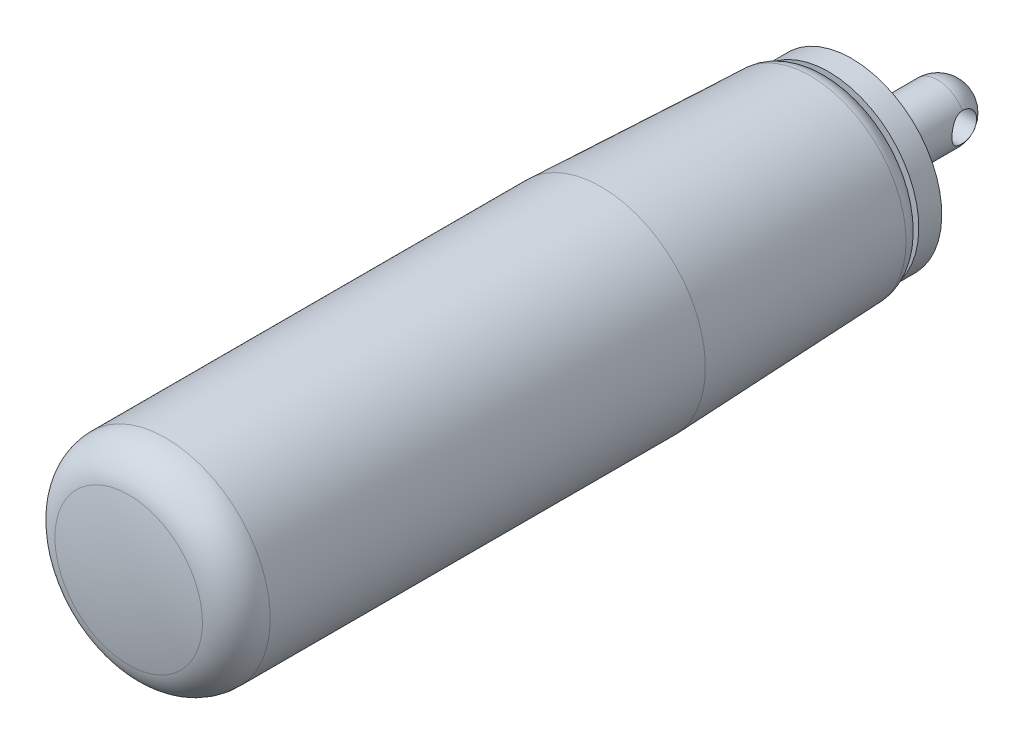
ISO-10303-21;
HEADER;
FILE_DESCRIPTION(('STEP AP214'),'2;1');
FILE_NAME('part.step','',(''),(''),'','','');
FILE_SCHEMA(('AUTOMOTIVE_DESIGN { 1 0 10303 214 1 1 1 1 }'));
ENDSEC;
DATA;
#1=APPLICATION_CONTEXT('core data for automotive mechanical design processes');
#2=APPLICATION_PROTOCOL_DEFINITION('international standard','automotive_design',2000,#1);
#3=PRODUCT_CONTEXT('',#1,'mechanical');
#4=PRODUCT('Part','Part','',(#3));
#5=PRODUCT_RELATED_PRODUCT_CATEGORY('part','',(#4));
#6=PRODUCT_DEFINITION_FORMATION('','',#4);
#7=PRODUCT_DEFINITION_CONTEXT('part definition',#1,'design');
#8=PRODUCT_DEFINITION('design','',#6,#7);
#9=PRODUCT_DEFINITION_SHAPE('','',#8);
#10=(LENGTH_UNIT() NAMED_UNIT(*) SI_UNIT(.MILLI.,.METRE.));
#11=(NAMED_UNIT(*) PLANE_ANGLE_UNIT() SI_UNIT($,.RADIAN.));
#12=(NAMED_UNIT(*) SI_UNIT($,.STERADIAN.) SOLID_ANGLE_UNIT());
#13=UNCERTAINTY_MEASURE_WITH_UNIT(LENGTH_MEASURE(1.E-05),#10,'distance_accuracy_value','');
#14=(GEOMETRIC_REPRESENTATION_CONTEXT(3) GLOBAL_UNCERTAINTY_ASSIGNED_CONTEXT((#13)) GLOBAL_UNIT_ASSIGNED_CONTEXT((#10,
#11,#12)) REPRESENTATION_CONTEXT('',''));
#15=CARTESIAN_POINT('',(0.,0.,0.));
#16=DIRECTION('',(0.,0.,1.));
#17=DIRECTION('',(1.,0.,0.));
#18=AXIS2_PLACEMENT_3D('',#15,#16,#17);
#19=CARTESIAN_POINT('',(0.,0.,46.0750337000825));
#20=DIRECTION('',(0.,1.,0.));
#21=DIRECTION('',(1.,0.,0.));
#22=AXIS2_PLACEMENT_3D('',#19,#20,#21);
#23=SPHERICAL_SURFACE('',#22,40.);
#24=CARTESIAN_POINT('',(0.,0.,46.0750337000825));
#25=DIRECTION('',(0.,0.,-1.));
#26=DIRECTION('',(0.,1.,0.));
#27=AXIS2_PLACEMENT_3D('',#24,#25,#26);
#28=SPHERICAL_SURFACE('',#27,40.);
#29=CARTESIAN_POINT('',(0.,0.,85.3115749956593));
#30=DIRECTION('',(0.,0.,-1.));
#31=DIRECTION('',(0.,1.,0.));
#32=AXIS2_PLACEMENT_3D('',#29,#30,#31);
#33=CIRCLE('',#32,7.77777777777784);
#34=CARTESIAN_POINT('',(0.,7.77777777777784,85.3115749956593));
#35=VERTEX_POINT('',#34);
#36=EDGE_CURVE('E110',#35,#35,#33,.T.);
#37=ORIENTED_EDGE('',*,*,#36,.F.);
#38=EDGE_LOOP('',(#37));
#39=FACE_BOUND('',#38,.T.);
#40=ADVANCED_FACE('F14',(#39),#28,.T.);
#41=CARTESIAN_POINT('',(0.,0.,0.));
#42=DIRECTION('',(0.,1.,0.));
#43=DIRECTION('',(1.,0.,0.));
#44=AXIS2_PLACEMENT_3D('',#41,#42,#43);
#45=SPHERICAL_SURFACE('',#44,3.);
#46=CARTESIAN_POINT('',(2.59807621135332,0.,0.));
#47=DIRECTION('',(-1.,0.,0.));
#48=DIRECTION('',(0.,1.,0.));
#49=AXIS2_PLACEMENT_3D('',#46,#47,#48);
#50=CIRCLE('',#49,1.5);
#51=CARTESIAN_POINT('',(2.59807621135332,-1.5,0.));
#52=VERTEX_POINT('',#51);
#53=CARTESIAN_POINT('',(2.59807621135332,1.5,0.));
#54=VERTEX_POINT('',#53);
#55=EDGE_CURVE('E38',#52,#54,#50,.F.);
#56=ORIENTED_EDGE('',*,*,#55,.F.);
#57=CARTESIAN_POINT('',(0.,0.,0.));
#58=DIRECTION('',(0.,0.,-1.));
#59=DIRECTION('',(0.,1.,0.));
#60=AXIS2_PLACEMENT_3D('',#57,#58,#59);
#61=CIRCLE('',#60,3.);
#62=CARTESIAN_POINT('',(-2.59807621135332,-1.5,0.));
#63=VERTEX_POINT('',#62);
#64=EDGE_CURVE('E48',#52,#63,#61,.T.);
#65=ORIENTED_EDGE('',*,*,#64,.T.);
#66=CARTESIAN_POINT('',(-2.59807621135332,0.,0.));
#67=DIRECTION('',(1.,0.,0.));
#68=DIRECTION('',(0.,-1.,0.));
#69=AXIS2_PLACEMENT_3D('',#66,#67,#68);
#70=CIRCLE('',#69,1.5);
#71=CARTESIAN_POINT('',(-2.59807621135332,1.5,0.));
#72=VERTEX_POINT('',#71);
#73=EDGE_CURVE('E31',#72,#63,#70,.F.);
#74=ORIENTED_EDGE('',*,*,#73,.F.);
#75=EDGE_CURVE('E52',#72,#54,#61,.T.);
#76=ORIENTED_EDGE('',*,*,#75,.T.);
#77=EDGE_LOOP('',(#56,#65,#74,#76));
#78=FACE_BOUND('',#77,.T.);
#79=ADVANCED_FACE('F51',(#78),#45,.T.);
#80=CARTESIAN_POINT('',(0.,0.,-20.));
#81=DIRECTION('',(0.,0.,-1.));
#82=DIRECTION('',(0.,1.,0.));
#83=AXIS2_PLACEMENT_3D('',#80,#81,#82);
#84=CYLINDRICAL_SURFACE('',#83,3.);
#85=CARTESIAN_POINT('',(-2.59807621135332,-1.5,0.));
#86=CARTESIAN_POINT('',(-2.59808302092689,-1.4999945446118,0.0781617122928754));
#87=CARTESIAN_POINT('',(-2.60165701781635,-1.49384995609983,0.156422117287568));
#88=CARTESIAN_POINT('',(-2.61543549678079,-1.46958481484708,0.31054089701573));
#89=CARTESIAN_POINT('',(-2.62565391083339,-1.45143909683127,0.386393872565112));
#90=CARTESIAN_POINT('',(-2.65124019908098,-1.40414992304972,0.533177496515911));
#91=CARTESIAN_POINT('',(-2.66658065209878,-1.3750649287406,0.604131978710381));
#92=CARTESIAN_POINT('',(-2.70063997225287,-1.30690128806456,0.74013630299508));
#93=CARTESIAN_POINT('',(-2.71935902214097,-1.26782210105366,0.805185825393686));
#94=CARTESIAN_POINT('',(-2.75995303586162,-1.17699981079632,0.933458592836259));
#95=CARTESIAN_POINT('',(-2.7819609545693,-1.12447805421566,0.996088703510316));
#96=CARTESIAN_POINT('',(-2.82557974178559,-1.0098807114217,1.11211258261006));
#97=CARTESIAN_POINT('',(-2.84719040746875,-0.94780038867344,1.16550174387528));
#98=CARTESIAN_POINT('',(-2.88932215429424,-0.81073434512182,1.26505072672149));
#99=CARTESIAN_POINT('',(-2.90967159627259,-0.735160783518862,1.3104806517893));
#100=CARTESIAN_POINT('',(-2.94526134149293,-0.576235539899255,1.38771127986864));
#101=CARTESIAN_POINT('',(-2.96050486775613,-0.492888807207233,1.41952058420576));
#102=CARTESIAN_POINT('',(-2.98320691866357,-0.327067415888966,1.46625699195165));
#103=CARTESIAN_POINT('',(-2.99114220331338,-0.244952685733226,1.4822242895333));
#104=CARTESIAN_POINT('',(-3.000113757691,-0.0788559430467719,1.50024917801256));
#105=CARTESIAN_POINT('',(-3.00115420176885,0.0051249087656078,1.50231518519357));
#106=CARTESIAN_POINT('',(-2.99644472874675,0.164748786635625,1.49287998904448));
#107=CARTESIAN_POINT('',(-2.99127743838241,0.240481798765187,1.48254297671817));
#108=CARTESIAN_POINT('',(-2.97561367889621,0.388970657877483,1.45067873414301));
#109=CARTESIAN_POINT('',(-2.96511681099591,0.461726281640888,1.42915066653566));
#110=CARTESIAN_POINT('',(-2.93957374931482,0.60346408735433,1.37537615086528));
#111=CARTESIAN_POINT('',(-2.92446662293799,0.672380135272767,1.3429855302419));
#112=CARTESIAN_POINT('',(-2.89106468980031,0.803965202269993,1.26860487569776));
#113=CARTESIAN_POINT('',(-2.87276874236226,0.866631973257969,1.22661140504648));
#114=CARTESIAN_POINT('',(-2.83266591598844,0.990260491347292,1.12965697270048));
#115=CARTESIAN_POINT('',(-2.81069063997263,1.05050111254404,1.07384545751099));
#116=CARTESIAN_POINT('',(-2.76681510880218,1.16115655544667,0.953115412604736));
#117=CARTESIAN_POINT('',(-2.74491492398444,1.21156381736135,0.888189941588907));
#118=CARTESIAN_POINT('',(-2.70216234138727,1.30425800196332,0.746027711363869));
#119=CARTESIAN_POINT('',(-2.68146479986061,1.34582597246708,0.668270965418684));
#120=CARTESIAN_POINT('',(-2.64563175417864,1.41497866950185,0.505593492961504));
#121=CARTESIAN_POINT('',(-2.63049045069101,1.44257798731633,0.420680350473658));
#122=CARTESIAN_POINT('',(-2.60916953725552,1.48077031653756,0.253178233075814));
#123=CARTESIAN_POINT('',(-2.60237483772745,1.49253768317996,0.170938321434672));
#124=CARTESIAN_POINT('',(-2.59676879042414,1.50227541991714,0.00539798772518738));
#125=CARTESIAN_POINT('',(-2.59795180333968,1.50025553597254,-0.0779016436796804));
#126=CARTESIAN_POINT('',(-2.60751504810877,1.48355406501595,-0.233480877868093));
#127=CARTESIAN_POINT('',(-2.61509381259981,1.4702817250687,-0.305969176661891));
#128=CARTESIAN_POINT('',(-2.63541032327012,1.43354442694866,-0.447551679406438));
#129=CARTESIAN_POINT('',(-2.64814974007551,1.41007616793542,-0.516644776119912));
#130=CARTESIAN_POINT('',(-2.67804333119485,1.35247138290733,-0.653116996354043));
#131=CARTESIAN_POINT('',(-2.69537464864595,1.31789109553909,-0.720268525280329));
#132=CARTESIAN_POINT('',(-2.73234179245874,1.23943059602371,-0.848203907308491));
#133=CARTESIAN_POINT('',(-2.75197880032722,1.19554560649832,-0.908984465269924));
#134=CARTESIAN_POINT('',(-2.79431997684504,1.09325575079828,-1.03046815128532));
#135=CARTESIAN_POINT('',(-2.81709874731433,1.03371790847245,-1.09019572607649));
#136=CARTESIAN_POINT('',(-2.86101352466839,0.905106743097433,-1.19911835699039));
#137=CARTESIAN_POINT('',(-2.88214897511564,0.836030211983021,-1.24830985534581));
#138=CARTESIAN_POINT('',(-2.92112042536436,0.687803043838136,-1.33586058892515));
#139=CARTESIAN_POINT('',(-2.93885462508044,0.608434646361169,-1.37389967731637));
#140=CARTESIAN_POINT('',(-2.96825032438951,0.443283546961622,-1.43570685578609));
#141=CARTESIAN_POINT('',(-2.9799171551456,0.357506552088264,-1.45948747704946));
#142=CARTESIAN_POINT('',(-2.99501262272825,0.190469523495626,-1.49005284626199));
#143=CARTESIAN_POINT('',(-2.99909891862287,0.109517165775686,-1.49819681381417));
#144=CARTESIAN_POINT('',(-3.00063195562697,-0.0526889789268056,-1.5012648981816));
#145=CARTESIAN_POINT('',(-2.99808102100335,-0.13394265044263,-1.49619364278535));
#146=CARTESIAN_POINT('',(-2.98700953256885,-0.288806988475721,-1.47387538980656));
#147=CARTESIAN_POINT('',(-2.97889342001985,-0.362568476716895,-1.45745272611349));
#148=CARTESIAN_POINT('',(-2.95788140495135,-0.506168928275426,-1.41400950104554));
#149=CARTESIAN_POINT('',(-2.94498481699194,-0.576007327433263,-1.38698741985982));
#150=CARTESIAN_POINT('',(-2.91488896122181,-0.713135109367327,-1.32190942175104));
#151=CARTESIAN_POINT('',(-2.89752925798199,-0.780187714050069,-1.28343101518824));
#152=CARTESIAN_POINT('',(-2.86032199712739,-0.907161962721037,-1.19706310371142));
#153=CARTESIAN_POINT('',(-2.84047329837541,-0.967080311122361,-1.14916927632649));
#154=CARTESIAN_POINT('',(-2.79792915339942,-1.08437100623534,-1.03980429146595));
#155=CARTESIAN_POINT('',(-2.77514698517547,-1.14089652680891,-0.977456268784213));
#156=CARTESIAN_POINT('',(-2.73094614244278,-1.24299493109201,-0.843823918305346));
#157=CARTESIAN_POINT('',(-2.70952868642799,-1.28855812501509,-0.772531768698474));
#158=CARTESIAN_POINT('',(-2.66999407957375,-1.36864661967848,-0.620045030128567));
#159=CARTESIAN_POINT('',(-2.65200261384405,-1.40277759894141,-0.538608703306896));
#160=CARTESIAN_POINT('',(-2.62299234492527,-1.45631806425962,-0.370001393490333));
#161=CARTESIAN_POINT('',(-2.61195024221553,-1.47577678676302,-0.28285066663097));
#162=CARTESIAN_POINT('',(-2.60293908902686,-1.49155051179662,-0.162291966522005));
#163=CARTESIAN_POINT('',(-2.60112193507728,-1.49471415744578,-0.129948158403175));
#164=CARTESIAN_POINT('',(-2.59868903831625,-1.49894010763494,-0.0650752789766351));
#165=CARTESIAN_POINT('',(-2.59807337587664,-1.50000227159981,-0.0325461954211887));
#166=CARTESIAN_POINT('',(-2.59807621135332,-1.5,0.));
#167=B_SPLINE_CURVE_WITH_KNOTS('',3,(#85,#86,#87,#88,#89,#90,#91,#92,#93,#94,#95,#96,#97,#98,
#99,#100,#101,#102,#103,#104,#105,#106,#107,#108,#109,#110,#111,#112,#113,#114,#115,#116,#117,
#118,#119,#120,#121,#122,#123,#124,#125,#126,#127,#128,#129,#130,#131,#132,#133,#134,#135,#136,
#137,#138,#139,#140,#141,#142,#143,#144,#145,#146,#147,#148,#149,#150,#151,#152,#153,#154,#155,
#156,#157,#158,#159,#160,#161,#162,#163,#164,#165,#166),.UNSPECIFIED.,.T.,.F.,(4,2,2,2,2,2,2,2,
2,2,2,2,2,2,2,2,2,2,2,2,2,2,2,2,2,2,2,2,2,2,2,2,2,2,2,2,2,2,2,2,4),(0.,0.234348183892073,
0.469189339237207,0.702792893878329,0.936409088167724,1.18929346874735,1.44230356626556,
1.71236838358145,1.98226240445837,2.23295227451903,2.4834903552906,2.71224146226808,
2.94100968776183,3.1729430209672,3.40495949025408,3.65890787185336,3.91305072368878,
4.18333262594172,4.45333161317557,4.70193436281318,4.95036139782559,5.17161275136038,
5.39293578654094,5.62450944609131,5.85620229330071,6.1171011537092,6.37808797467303,
6.64596272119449,6.91360169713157,7.1566840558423,7.39968130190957,7.62666637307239,
7.85368400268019,8.09041126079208,8.32724745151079,8.58765362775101,8.84828914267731,
9.11716123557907,9.3851269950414,9.48270202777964,9.58028358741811),.UNSPECIFIED.);
#168=EDGE_CURVE('E9',#63,#72,#167,.T.);
#169=ORIENTED_EDGE('',*,*,#168,.F.);
#170=ORIENTED_EDGE('',*,*,#64,.F.);
#171=CARTESIAN_POINT('',(2.59807621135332,-1.5,0.));
#172=CARTESIAN_POINT('',(2.59808302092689,-1.4999945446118,-0.0781617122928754));
#173=CARTESIAN_POINT('',(2.60165701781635,-1.49384995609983,-0.156422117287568));
#174=CARTESIAN_POINT('',(2.61543549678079,-1.46958481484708,-0.31054089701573));
#175=CARTESIAN_POINT('',(2.62565391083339,-1.45143909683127,-0.386393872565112));
#176=CARTESIAN_POINT('',(2.65124019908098,-1.40414992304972,-0.533177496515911));
#177=CARTESIAN_POINT('',(2.66658065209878,-1.3750649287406,-0.604131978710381));
#178=CARTESIAN_POINT('',(2.70063997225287,-1.30690128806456,-0.74013630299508));
#179=CARTESIAN_POINT('',(2.71935902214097,-1.26782210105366,-0.805185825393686));
#180=CARTESIAN_POINT('',(2.75995303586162,-1.17699981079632,-0.933458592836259));
#181=CARTESIAN_POINT('',(2.7819609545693,-1.12447805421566,-0.996088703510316));
#182=CARTESIAN_POINT('',(2.82557974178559,-1.0098807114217,-1.11211258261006));
#183=CARTESIAN_POINT('',(2.84719040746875,-0.94780038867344,-1.16550174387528));
#184=CARTESIAN_POINT('',(2.88932215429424,-0.81073434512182,-1.26505072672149));
#185=CARTESIAN_POINT('',(2.90967159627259,-0.735160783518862,-1.3104806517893));
#186=CARTESIAN_POINT('',(2.94526134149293,-0.576235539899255,-1.38771127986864));
#187=CARTESIAN_POINT('',(2.96050486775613,-0.492888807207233,-1.41952058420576));
#188=CARTESIAN_POINT('',(2.98320691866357,-0.327067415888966,-1.46625699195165));
#189=CARTESIAN_POINT('',(2.99114220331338,-0.244952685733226,-1.4822242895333));
#190=CARTESIAN_POINT('',(3.000113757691,-0.0788559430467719,-1.50024917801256));
#191=CARTESIAN_POINT('',(3.00115420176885,0.0051249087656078,-1.50231518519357));
#192=CARTESIAN_POINT('',(2.99644472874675,0.164748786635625,-1.49287998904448));
#193=CARTESIAN_POINT('',(2.99127743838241,0.240481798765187,-1.48254297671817));
#194=CARTESIAN_POINT('',(2.97561367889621,0.388970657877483,-1.45067873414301));
#195=CARTESIAN_POINT('',(2.96511681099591,0.461726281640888,-1.42915066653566));
#196=CARTESIAN_POINT('',(2.93957374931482,0.60346408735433,-1.37537615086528));
#197=CARTESIAN_POINT('',(2.92446662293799,0.672380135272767,-1.3429855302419));
#198=CARTESIAN_POINT('',(2.89106468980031,0.803965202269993,-1.26860487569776));
#199=CARTESIAN_POINT('',(2.87276874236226,0.866631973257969,-1.22661140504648));
#200=CARTESIAN_POINT('',(2.83266591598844,0.990260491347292,-1.12965697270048));
#201=CARTESIAN_POINT('',(2.81069063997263,1.05050111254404,-1.07384545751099));
#202=CARTESIAN_POINT('',(2.76681510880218,1.16115655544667,-0.953115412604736));
#203=CARTESIAN_POINT('',(2.74491492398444,1.21156381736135,-0.888189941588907));
#204=CARTESIAN_POINT('',(2.70216234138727,1.30425800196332,-0.746027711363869));
#205=CARTESIAN_POINT('',(2.68146479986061,1.34582597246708,-0.668270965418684));
#206=CARTESIAN_POINT('',(2.64563175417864,1.41497866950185,-0.505593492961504));
#207=CARTESIAN_POINT('',(2.63049045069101,1.44257798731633,-0.420680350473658));
#208=CARTESIAN_POINT('',(2.60916953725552,1.48077031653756,-0.253178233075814));
#209=CARTESIAN_POINT('',(2.60237483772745,1.49253768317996,-0.170938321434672));
#210=CARTESIAN_POINT('',(2.59676879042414,1.50227541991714,-0.00539798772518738));
#211=CARTESIAN_POINT('',(2.59795180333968,1.50025553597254,0.0779016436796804));
#212=CARTESIAN_POINT('',(2.60751504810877,1.48355406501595,0.233480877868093));
#213=CARTESIAN_POINT('',(2.61509381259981,1.4702817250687,0.305969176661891));
#214=CARTESIAN_POINT('',(2.63541032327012,1.43354442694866,0.447551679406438));
#215=CARTESIAN_POINT('',(2.64814974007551,1.41007616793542,0.516644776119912));
#216=CARTESIAN_POINT('',(2.67804333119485,1.35247138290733,0.653116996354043));
#217=CARTESIAN_POINT('',(2.69537464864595,1.31789109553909,0.720268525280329));
#218=CARTESIAN_POINT('',(2.73234179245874,1.23943059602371,0.848203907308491));
#219=CARTESIAN_POINT('',(2.75197880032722,1.19554560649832,0.908984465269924));
#220=CARTESIAN_POINT('',(2.79431997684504,1.09325575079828,1.03046815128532));
#221=CARTESIAN_POINT('',(2.81709874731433,1.03371790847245,1.09019572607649));
#222=CARTESIAN_POINT('',(2.86101352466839,0.905106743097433,1.19911835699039));
#223=CARTESIAN_POINT('',(2.88214897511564,0.836030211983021,1.24830985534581));
#224=CARTESIAN_POINT('',(2.92112042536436,0.687803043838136,1.33586058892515));
#225=CARTESIAN_POINT('',(2.93885462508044,0.608434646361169,1.37389967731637));
#226=CARTESIAN_POINT('',(2.96825032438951,0.443283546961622,1.43570685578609));
#227=CARTESIAN_POINT('',(2.9799171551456,0.357506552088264,1.45948747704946));
#228=CARTESIAN_POINT('',(2.99501262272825,0.190469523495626,1.49005284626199));
#229=CARTESIAN_POINT('',(2.99909891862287,0.109517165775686,1.49819681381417));
#230=CARTESIAN_POINT('',(3.00063195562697,-0.0526889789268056,1.5012648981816));
#231=CARTESIAN_POINT('',(2.99808102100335,-0.13394265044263,1.49619364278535));
#232=CARTESIAN_POINT('',(2.98700953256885,-0.288806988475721,1.47387538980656));
#233=CARTESIAN_POINT('',(2.97889342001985,-0.362568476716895,1.45745272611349));
#234=CARTESIAN_POINT('',(2.95788140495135,-0.506168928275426,1.41400950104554));
#235=CARTESIAN_POINT('',(2.94498481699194,-0.576007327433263,1.38698741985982));
#236=CARTESIAN_POINT('',(2.91488896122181,-0.713135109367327,1.32190942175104));
#237=CARTESIAN_POINT('',(2.89752925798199,-0.780187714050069,1.28343101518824));
#238=CARTESIAN_POINT('',(2.86032199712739,-0.907161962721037,1.19706310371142));
#239=CARTESIAN_POINT('',(2.84047329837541,-0.967080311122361,1.14916927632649));
#240=CARTESIAN_POINT('',(2.79792915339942,-1.08437100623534,1.03980429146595));
#241=CARTESIAN_POINT('',(2.77514698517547,-1.14089652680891,0.977456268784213));
#242=CARTESIAN_POINT('',(2.73094614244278,-1.24299493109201,0.843823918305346));
#243=CARTESIAN_POINT('',(2.70952868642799,-1.28855812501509,0.772531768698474));
#244=CARTESIAN_POINT('',(2.66999407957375,-1.36864661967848,0.620045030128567));
#245=CARTESIAN_POINT('',(2.65200261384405,-1.40277759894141,0.538608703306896));
#246=CARTESIAN_POINT('',(2.62299234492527,-1.45631806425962,0.370001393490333));
#247=CARTESIAN_POINT('',(2.61195024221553,-1.47577678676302,0.28285066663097));
#248=CARTESIAN_POINT('',(2.60293908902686,-1.49155051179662,0.162291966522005));
#249=CARTESIAN_POINT('',(2.60112193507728,-1.49471415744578,0.129948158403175));
#250=CARTESIAN_POINT('',(2.59868903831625,-1.49894010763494,0.0650752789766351));
#251=CARTESIAN_POINT('',(2.59807337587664,-1.50000227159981,0.0325461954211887));
#252=CARTESIAN_POINT('',(2.59807621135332,-1.5,0.));
#253=B_SPLINE_CURVE_WITH_KNOTS('',3,(#171,#172,#173,#174,#175,#176,#177,#178,#179,#180,#181,
#182,#183,#184,#185,#186,#187,#188,#189,#190,#191,#192,#193,#194,#195,#196,#197,#198,#199,#200,
#201,#202,#203,#204,#205,#206,#207,#208,#209,#210,#211,#212,#213,#214,#215,#216,#217,#218,#219,
#220,#221,#222,#223,#224,#225,#226,#227,#228,#229,#230,#231,#232,#233,#234,#235,#236,#237,#238,
#239,#240,#241,#242,#243,#244,#245,#246,#247,#248,#249,#250,#251,#252),.UNSPECIFIED.,.T.,.F.,(4,
2,2,2,2,2,2,2,2,2,2,2,2,2,2,2,2,2,2,2,2,2,2,2,2,2,2,2,2,2,2,2,2,2,2,2,2,2,2,2,4),(0.,
0.234348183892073,0.469189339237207,0.702792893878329,0.936409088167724,1.18929346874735,
1.44230356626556,1.71236838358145,1.98226240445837,2.23295227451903,2.4834903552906,
2.71224146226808,2.94100968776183,3.1729430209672,3.40495949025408,3.65890787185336,
3.91305072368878,4.18333262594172,4.45333161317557,4.70193436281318,4.95036139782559,
5.17161275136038,5.39293578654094,5.62450944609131,5.85620229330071,6.1171011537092,
6.37808797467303,6.64596272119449,6.91360169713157,7.1566840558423,7.39968130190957,
7.62666637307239,7.85368400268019,8.09041126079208,8.32724745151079,8.58765362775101,
8.84828914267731,9.11716123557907,9.3851269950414,9.48270202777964,9.58028358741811),.UNSPECIFIED.);
#254=EDGE_CURVE('E26',#54,#52,#253,.T.);
#255=ORIENTED_EDGE('',*,*,#254,.F.);
#256=ORIENTED_EDGE('',*,*,#75,.F.);
#257=EDGE_LOOP('',(#169,#170,#255,#256));
#258=FACE_BOUND('',#257,.T.);
#259=CARTESIAN_POINT('',(0.,0.,9.07503370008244));
#260=DIRECTION('',(0.,0.,-1.));
#261=DIRECTION('',(0.,1.,0.));
#262=AXIS2_PLACEMENT_3D('',#259,#260,#261);
#263=CIRCLE('',#262,3.);
#264=CARTESIAN_POINT('',(0.,3.,9.07503370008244));
#265=VERTEX_POINT('',#264);
#266=EDGE_CURVE('E57',#265,#265,#263,.T.);
#267=ORIENTED_EDGE('',*,*,#266,.T.);
#268=EDGE_LOOP('',(#267));
#269=FACE_BOUND('',#268,.T.);
#270=ADVANCED_FACE('F54',(#258,#269),#84,.T.);
#271=CARTESIAN_POINT('',(-9.49999999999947,0.,9.07503370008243));
#272=DIRECTION('',(0.,0.,1.));
#273=DIRECTION('',(0.,-1.,0.));
#274=AXIS2_PLACEMENT_3D('',#271,#272,#273);
#275=PLANE('',#274);
#276=ORIENTED_EDGE('',*,*,#266,.F.);
#277=EDGE_LOOP('',(#276));
#278=FACE_BOUND('',#277,.T.);
#279=CARTESIAN_POINT('',(0.,0.,9.07503370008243));
#280=DIRECTION('',(0.,0.,-1.));
#281=DIRECTION('',(0.,1.,0.));
#282=AXIS2_PLACEMENT_3D('',#279,#280,#281);
#283=CIRCLE('',#282,9.49999999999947);
#284=CARTESIAN_POINT('',(0.,9.49999999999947,9.07503370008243));
#285=VERTEX_POINT('',#284);
#286=EDGE_CURVE('E128',#285,#285,#283,.T.);
#287=ORIENTED_EDGE('',*,*,#286,.T.);
#288=EDGE_LOOP('',(#287));
#289=FACE_BOUND('',#288,.T.);
#290=ADVANCED_FACE('F91',(#278,#289),#275,.F.);
#291=CARTESIAN_POINT('',(0.,0.,-20.));
#292=DIRECTION('',(0.,0.,-1.));
#293=DIRECTION('',(0.,1.,0.));
#294=AXIS2_PLACEMENT_3D('',#291,#292,#293);
#295=CYLINDRICAL_SURFACE('',#294,9.49999999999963);
#296=ORIENTED_EDGE('',*,*,#286,.F.);
#297=EDGE_LOOP('',(#296));
#298=FACE_BOUND('',#297,.T.);
#299=CARTESIAN_POINT('',(0.,0.,11.5));
#300=DIRECTION('',(0.,0.,-1.));
#301=DIRECTION('',(0.,1.,0.));
#302=AXIS2_PLACEMENT_3D('',#299,#300,#301);
#303=CIRCLE('',#302,9.49999999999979);
#304=CARTESIAN_POINT('',(0.,9.49999999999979,11.5));
#305=VERTEX_POINT('',#304);
#306=EDGE_CURVE('E126',#305,#305,#303,.T.);
#307=ORIENTED_EDGE('',*,*,#306,.T.);
#308=EDGE_LOOP('',(#307));
#309=FACE_BOUND('',#308,.T.);
#310=ADVANCED_FACE('F88',(#298,#309),#295,.T.);
#311=CARTESIAN_POINT('',(-8.08159797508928,0.,11.5));
#312=DIRECTION('',(0.,0.,-1.));
#313=DIRECTION('',(0.,1.,0.));
#314=AXIS2_PLACEMENT_3D('',#311,#312,#313);
#315=PLANE('',#314);
#316=ORIENTED_EDGE('',*,*,#306,.F.);
#317=EDGE_LOOP('',(#316));
#318=FACE_BOUND('',#317,.T.);
#319=CARTESIAN_POINT('',(0.,0.,11.5));
#320=DIRECTION('',(0.,0.,-1.));
#321=DIRECTION('',(0.,1.,0.));
#322=AXIS2_PLACEMENT_3D('',#319,#320,#321);
#323=CIRCLE('',#322,8.08159797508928);
#324=CARTESIAN_POINT('',(0.,8.08159797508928,11.5));
#325=VERTEX_POINT('',#324);
#326=EDGE_CURVE('E123',#325,#325,#323,.T.);
#327=ORIENTED_EDGE('',*,*,#326,.T.);
#328=EDGE_LOOP('',(#327));
#329=FACE_BOUND('',#328,.T.);
#330=ADVANCED_FACE('F84',(#318,#329),#315,.F.);
#331=CARTESIAN_POINT('',(0.,0.,13.5));
#332=DIRECTION('',(0.,0.,-1.));
#333=DIRECTION('',(0.,1.,0.));
#334=AXIS2_PLACEMENT_3D('',#331,#332,#333);
#335=TOROIDAL_SURFACE('',#334,8.08159797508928,1.99999999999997);
#336=CARTESIAN_POINT('',(0.,0.,13.4167389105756));
#337=DIRECTION('',(0.,0.,-1.));
#338=DIRECTION('',(0.,1.,0.));
#339=AXIS2_PLACEMENT_3D('',#336,#337,#338);
#340=CIRCLE('',#339,10.079864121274);
#341=CARTESIAN_POINT('',(0.,10.079864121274,13.4167389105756));
#342=VERTEX_POINT('',#341);
#343=EDGE_CURVE('E120',#342,#342,#340,.T.);
#344=ORIENTED_EDGE('',*,*,#343,.T.);
#345=EDGE_LOOP('',(#344));
#346=FACE_BOUND('',#345,.T.);
#347=ORIENTED_EDGE('',*,*,#326,.F.);
#348=EDGE_LOOP('',(#347));
#349=FACE_BOUND('',#348,.T.);
#350=ADVANCED_FACE('F80',(#346,#349),#335,.T.);
#351=CARTESIAN_POINT('',(0.,0.,35.4999999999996));
#352=DIRECTION('',(0.,0.,1.));
#353=DIRECTION('',(0.,-1.,0.));
#354=AXIS2_PLACEMENT_3D('',#351,#352,#353);
#355=CONICAL_SURFACE('',#354,11.,0.0416425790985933);
#356=ORIENTED_EDGE('',*,*,#343,.F.);
#357=EDGE_LOOP('',(#356));
#358=FACE_BOUND('',#357,.T.);
#359=CARTESIAN_POINT('',(0.,0.,35.4999999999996));
#360=DIRECTION('',(0.,0.,-1.));
#361=DIRECTION('',(0.,1.,0.));
#362=AXIS2_PLACEMENT_3D('',#359,#360,#361);
#363=CIRCLE('',#362,11.);
#364=CARTESIAN_POINT('',(0.,11.,35.4999999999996));
#365=VERTEX_POINT('',#364);
#366=EDGE_CURVE('E114',#365,#365,#363,.T.);
#367=ORIENTED_EDGE('',*,*,#366,.T.);
#368=EDGE_LOOP('',(#367));
#369=FACE_BOUND('',#368,.T.);
#370=ADVANCED_FACE('F76',(#358,#369),#355,.T.);
#371=CARTESIAN_POINT('',(0.,0.,-20.));
#372=DIRECTION('',(0.,0.,-1.));
#373=DIRECTION('',(0.,1.,0.));
#374=AXIS2_PLACEMENT_3D('',#371,#372,#373);
#375=CYLINDRICAL_SURFACE('',#374,11.);
#376=CARTESIAN_POINT('',(0.,0.,81.3879208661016));
#377=DIRECTION('',(0.,0.,-1.));
#378=DIRECTION('',(0.,1.,0.));
#379=AXIS2_PLACEMENT_3D('',#376,#377,#378);
#380=CIRCLE('',#379,11.);
#381=CARTESIAN_POINT('',(0.,11.,81.3879208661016));
#382=VERTEX_POINT('',#381);
#383=EDGE_CURVE('E111',#382,#382,#380,.T.);
#384=ORIENTED_EDGE('',*,*,#383,.T.);
#385=EDGE_LOOP('',(#384));
#386=FACE_BOUND('',#385,.T.);
#387=ORIENTED_EDGE('',*,*,#366,.F.);
#388=EDGE_LOOP('',(#387));
#389=FACE_BOUND('',#388,.T.);
#390=ADVANCED_FACE('F72',(#386,#389),#375,.T.);
#391=CARTESIAN_POINT('',(0.,0.,81.3879208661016));
#392=DIRECTION('',(0.,0.,-1.));
#393=DIRECTION('',(0.,1.,0.));
#394=AXIS2_PLACEMENT_3D('',#391,#392,#393);
#395=TOROIDAL_SURFACE('',#394,7.,4.);
#396=ORIENTED_EDGE('',*,*,#36,.T.);
#397=EDGE_LOOP('',(#396));
#398=FACE_BOUND('',#397,.T.);
#399=ORIENTED_EDGE('',*,*,#383,.F.);
#400=EDGE_LOOP('',(#399));
#401=FACE_BOUND('',#400,.T.);
#402=ADVANCED_FACE('F68',(#398,#401),#395,.T.);
#403=CARTESIAN_POINT('',(-5.,0.,0.));
#404=DIRECTION('',(1.,0.,0.));
#405=DIRECTION('',(0.,-1.,0.));
#406=AXIS2_PLACEMENT_3D('',#403,#404,#405);
#407=CYLINDRICAL_SURFACE('',#406,1.5);
#408=ORIENTED_EDGE('',*,*,#73,.T.);
#409=ORIENTED_EDGE('',*,*,#168,.T.);
#410=EDGE_LOOP('',(#408,#409));
#411=FACE_BOUND('',#410,.T.);
#412=ORIENTED_EDGE('',*,*,#55,.T.);
#413=ORIENTED_EDGE('',*,*,#254,.T.);
#414=EDGE_LOOP('',(#412,#413));
#415=FACE_BOUND('',#414,.T.);
#416=ADVANCED_FACE('F43',(#411,#415),#407,.F.);
#417=CLOSED_SHELL('',(#40,#79,#270,#290,#310,#330,#350,#370,#390,#402,#416));
#418=MANIFOLD_SOLID_BREP('B1',#417);
#419=ADVANCED_BREP_SHAPE_REPRESENTATION('',(#18,#418),#14);
#420=SHAPE_DEFINITION_REPRESENTATION(#9,#419);
ENDSEC;
END-ISO-10303-21;
